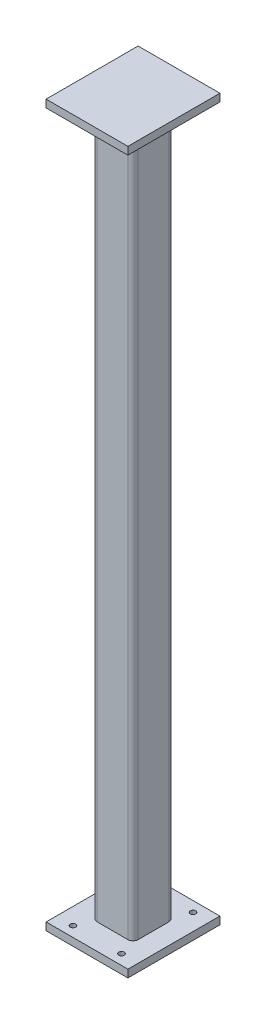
ISO-10303-21;
HEADER;
FILE_DESCRIPTION(('STEP AP214'),'2;1');
FILE_NAME('part.step','',(''),(''),'','','');
FILE_SCHEMA(('AUTOMOTIVE_DESIGN { 1 0 10303 214 1 1 1 1 }'));
ENDSEC;
DATA;
#1=APPLICATION_CONTEXT('core data for automotive mechanical design processes');
#2=APPLICATION_PROTOCOL_DEFINITION('international standard','automotive_design',2000,#1);
#3=PRODUCT_CONTEXT('',#1,'mechanical');
#4=PRODUCT('Part','Part','',(#3));
#5=PRODUCT_RELATED_PRODUCT_CATEGORY('part','',(#4));
#6=PRODUCT_DEFINITION_FORMATION('','',#4);
#7=PRODUCT_DEFINITION_CONTEXT('part definition',#1,'design');
#8=PRODUCT_DEFINITION('design','',#6,#7);
#9=PRODUCT_DEFINITION_SHAPE('','',#8);
#10=(LENGTH_UNIT() NAMED_UNIT(*) SI_UNIT(.MILLI.,.METRE.));
#11=(NAMED_UNIT(*) PLANE_ANGLE_UNIT() SI_UNIT($,.RADIAN.));
#12=(NAMED_UNIT(*) SI_UNIT($,.STERADIAN.) SOLID_ANGLE_UNIT());
#13=UNCERTAINTY_MEASURE_WITH_UNIT(LENGTH_MEASURE(1.E-05),#10,'distance_accuracy_value','');
#14=(GEOMETRIC_REPRESENTATION_CONTEXT(3) GLOBAL_UNCERTAINTY_ASSIGNED_CONTEXT((#13)) GLOBAL_UNIT_ASSIGNED_CONTEXT((#10,
#11,#12)) REPRESENTATION_CONTEXT('',''));
#15=CARTESIAN_POINT('',(0.,0.,0.));
#16=DIRECTION('',(0.,0.,1.));
#17=DIRECTION('',(1.,0.,0.));
#18=AXIS2_PLACEMENT_3D('',#15,#16,#17);
#19=CARTESIAN_POINT('',(50.8,9.525,-57.15));
#20=DIRECTION('',(0.,-1.,0.));
#21=DIRECTION('',(0.,0.,-1.));
#22=AXIS2_PLACEMENT_3D('',#19,#20,#21);
#23=PLANE('',#22);
#24=CARTESIAN_POINT('',(30.1625,9.525,44.45));
#25=DIRECTION('',(0.,1.,0.));
#26=DIRECTION('',(0.,0.,1.));
#27=AXIS2_PLACEMENT_3D('',#24,#25,#26);
#28=CIRCLE('',#27,3.37819999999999);
#29=CARTESIAN_POINT('',(30.1625,9.525,47.8282));
#30=VERTEX_POINT('',#29);
#31=EDGE_CURVE('E490',#30,#30,#28,.T.);
#32=ORIENTED_EDGE('',*,*,#31,.F.);
#33=EDGE_LOOP('',(#32));
#34=FACE_BOUND('',#33,.T.);
#35=CARTESIAN_POINT('',(30.1625,9.525,-44.45));
#36=DIRECTION('',(0.,1.,0.));
#37=DIRECTION('',(0.,0.,1.));
#38=AXIS2_PLACEMENT_3D('',#35,#36,#37);
#39=CIRCLE('',#38,3.37819999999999);
#40=CARTESIAN_POINT('',(30.1625,9.525,-41.0718));
#41=VERTEX_POINT('',#40);
#42=EDGE_CURVE('E492',#41,#41,#39,.T.);
#43=ORIENTED_EDGE('',*,*,#42,.F.);
#44=EDGE_LOOP('',(#43));
#45=FACE_BOUND('',#44,.T.);
#46=CARTESIAN_POINT('',(-30.1625,9.525,-44.45));
#47=DIRECTION('',(0.,1.,0.));
#48=DIRECTION('',(0.,0.,1.));
#49=AXIS2_PLACEMENT_3D('',#46,#47,#48);
#50=CIRCLE('',#49,3.37819999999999);
#51=CARTESIAN_POINT('',(-30.1625,9.525,-41.0718));
#52=VERTEX_POINT('',#51);
#53=EDGE_CURVE('E500',#52,#52,#50,.T.);
#54=ORIENTED_EDGE('',*,*,#53,.F.);
#55=EDGE_LOOP('',(#54));
#56=FACE_BOUND('',#55,.T.);
#57=CARTESIAN_POINT('',(-30.1625,9.525,44.45));
#58=DIRECTION('',(0.,1.,0.));
#59=DIRECTION('',(0.,0.,1.));
#60=AXIS2_PLACEMENT_3D('',#57,#58,#59);
#61=CIRCLE('',#60,3.37819999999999);
#62=CARTESIAN_POINT('',(-30.1625,9.525,47.8282));
#63=VERTEX_POINT('',#62);
#64=EDGE_CURVE('E506',#63,#63,#61,.T.);
#65=ORIENTED_EDGE('',*,*,#64,.F.);
#66=EDGE_LOOP('',(#65));
#67=FACE_BOUND('',#66,.T.);
#68=DIRECTION('',(0.,0.,-1.));
#69=VECTOR('',#68,1.);
#70=CARTESIAN_POINT('',(50.8,9.525,57.15));
#71=LINE('',#70,#69);
#72=CARTESIAN_POINT('',(50.8,9.525,57.15));
#73=VERTEX_POINT('',#72);
#74=CARTESIAN_POINT('',(50.8,9.525,-57.15));
#75=VERTEX_POINT('',#74);
#76=EDGE_CURVE('E197',#73,#75,#71,.T.);
#77=ORIENTED_EDGE('',*,*,#76,.T.);
#78=DIRECTION('',(-1.,0.,0.));
#79=VECTOR('',#78,1.);
#80=CARTESIAN_POINT('',(-50.8,9.525,-57.15));
#81=LINE('',#80,#79);
#82=CARTESIAN_POINT('',(-50.8,9.525,-57.15));
#83=VERTEX_POINT('',#82);
#84=EDGE_CURVE('E200',#75,#83,#81,.T.);
#85=ORIENTED_EDGE('',*,*,#84,.T.);
#86=DIRECTION('',(0.,0.,1.));
#87=VECTOR('',#86,1.);
#88=CARTESIAN_POINT('',(-50.8,9.525,57.15));
#89=LINE('',#88,#87);
#90=CARTESIAN_POINT('',(-50.8,9.525,57.15));
#91=VERTEX_POINT('',#90);
#92=EDGE_CURVE('E203',#83,#91,#89,.T.);
#93=ORIENTED_EDGE('',*,*,#92,.T.);
#94=DIRECTION('',(1.,0.,0.));
#95=VECTOR('',#94,1.);
#96=CARTESIAN_POINT('',(-50.8,9.525,57.15));
#97=LINE('',#96,#95);
#98=EDGE_CURVE('E205',#91,#73,#97,.T.);
#99=ORIENTED_EDGE('',*,*,#98,.T.);
#100=EDGE_LOOP('',(#77,#85,#93,#99));
#101=FACE_BOUND('',#100,.T.);
#102=DIRECTION('',(0.,0.,-1.));
#103=VECTOR('',#102,1.);
#104=CARTESIAN_POINT('',(25.4,9.525,25.4));
#105=LINE('',#104,#103);
#106=CARTESIAN_POINT('',(25.4,9.525,19.05));
#107=VERTEX_POINT('',#106);
#108=CARTESIAN_POINT('',(25.4,9.525,-19.05));
#109=VERTEX_POINT('',#108);
#110=EDGE_CURVE('E170',#107,#109,#105,.T.);
#111=ORIENTED_EDGE('',*,*,#110,.F.);
#112=CARTESIAN_POINT('',(19.05,9.52500000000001,19.05));
#113=DIRECTION('',(0.,-1.,0.));
#114=DIRECTION('',(0.,0.,-1.));
#115=AXIS2_PLACEMENT_3D('',#112,#113,#114);
#116=CIRCLE('',#115,6.35);
#117=CARTESIAN_POINT('',(19.05,9.525,25.4));
#118=VERTEX_POINT('',#117);
#119=EDGE_CURVE('E253',#107,#118,#116,.T.);
#120=ORIENTED_EDGE('',*,*,#119,.T.);
#121=DIRECTION('',(1.,0.,0.));
#122=VECTOR('',#121,1.);
#123=CARTESIAN_POINT('',(-25.4,9.525,25.4));
#124=LINE('',#123,#122);
#125=CARTESIAN_POINT('',(-19.05,9.525,25.4));
#126=VERTEX_POINT('',#125);
#127=EDGE_CURVE('E183',#126,#118,#124,.T.);
#128=ORIENTED_EDGE('',*,*,#127,.F.);
#129=CARTESIAN_POINT('',(-19.05,9.52500000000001,19.05));
#130=DIRECTION('',(0.,-1.,0.));
#131=DIRECTION('',(0.,0.,-1.));
#132=AXIS2_PLACEMENT_3D('',#129,#130,#131);
#133=CIRCLE('',#132,6.35);
#134=CARTESIAN_POINT('',(-25.4,9.525,19.05));
#135=VERTEX_POINT('',#134);
#136=EDGE_CURVE('E40',#126,#135,#133,.T.);
#137=ORIENTED_EDGE('',*,*,#136,.T.);
#138=DIRECTION('',(0.,0.,1.));
#139=VECTOR('',#138,1.);
#140=CARTESIAN_POINT('',(-25.4,9.525,25.4));
#141=LINE('',#140,#139);
#142=CARTESIAN_POINT('',(-25.4,9.525,-19.05));
#143=VERTEX_POINT('',#142);
#144=EDGE_CURVE('E193',#143,#135,#141,.T.);
#145=ORIENTED_EDGE('',*,*,#144,.F.);
#146=CARTESIAN_POINT('',(-19.05,9.52500000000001,-19.05));
#147=DIRECTION('',(0.,-1.,0.));
#148=DIRECTION('',(0.,0.,-1.));
#149=AXIS2_PLACEMENT_3D('',#146,#147,#148);
#150=CIRCLE('',#149,6.35);
#151=CARTESIAN_POINT('',(-19.05,9.525,-25.4));
#152=VERTEX_POINT('',#151);
#153=EDGE_CURVE('E245',#143,#152,#150,.T.);
#154=ORIENTED_EDGE('',*,*,#153,.T.);
#155=DIRECTION('',(-1.,0.,0.));
#156=VECTOR('',#155,1.);
#157=CARTESIAN_POINT('',(-25.4,9.525,-25.4));
#158=LINE('',#157,#156);
#159=CARTESIAN_POINT('',(19.05,9.525,-25.4));
#160=VERTEX_POINT('',#159);
#161=EDGE_CURVE('E173',#160,#152,#158,.T.);
#162=ORIENTED_EDGE('',*,*,#161,.F.);
#163=CARTESIAN_POINT('',(19.05,9.52500000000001,-19.05));
#164=DIRECTION('',(0.,-1.,0.));
#165=DIRECTION('',(0.,0.,-1.));
#166=AXIS2_PLACEMENT_3D('',#163,#164,#165);
#167=CIRCLE('',#166,6.35);
#168=EDGE_CURVE('E249',#160,#109,#167,.T.);
#169=ORIENTED_EDGE('',*,*,#168,.T.);
#170=EDGE_LOOP('',(#111,#120,#128,#137,#145,#154,#162,#169));
#171=FACE_BOUND('',#170,.T.);
#172=ADVANCED_FACE('F32',(#34,#45,#56,#67,#101,#171),#23,.F.);
#173=CARTESIAN_POINT('',(50.8,9.525,57.15));
#174=DIRECTION('',(-1.,0.,0.));
#175=DIRECTION('',(0.,0.,1.));
#176=AXIS2_PLACEMENT_3D('',#173,#174,#175);
#177=PLANE('',#176);
#178=DIRECTION('',(0.,0.,-1.));
#179=VECTOR('',#178,1.);
#180=CARTESIAN_POINT('',(50.8,0.,57.15));
#181=LINE('',#180,#179);
#182=CARTESIAN_POINT('',(50.8,0.,57.15));
#183=VERTEX_POINT('',#182);
#184=CARTESIAN_POINT('',(50.8,0.,-57.15));
#185=VERTEX_POINT('',#184);
#186=EDGE_CURVE('E189',#183,#185,#181,.T.);
#187=ORIENTED_EDGE('',*,*,#186,.T.);
#188=DIRECTION('',(0.,-1.,0.));
#189=VECTOR('',#188,1.);
#190=CARTESIAN_POINT('',(50.8,9.525,-57.15));
#191=LINE('',#190,#189);
#192=EDGE_CURVE('E223',#75,#185,#191,.T.);
#193=ORIENTED_EDGE('',*,*,#192,.F.);
#194=ORIENTED_EDGE('',*,*,#76,.F.);
#195=DIRECTION('',(0.,-1.,0.));
#196=VECTOR('',#195,1.);
#197=CARTESIAN_POINT('',(50.8,9.525,57.15));
#198=LINE('',#197,#196);
#199=EDGE_CURVE('E207',#73,#183,#198,.T.);
#200=ORIENTED_EDGE('',*,*,#199,.T.);
#201=EDGE_LOOP('',(#187,#193,#194,#200));
#202=FACE_BOUND('',#201,.T.);
#203=ADVANCED_FACE('F300',(#202),#177,.F.);
#204=CARTESIAN_POINT('',(-50.8,9.525,-57.15));
#205=DIRECTION('',(0.,0.,1.));
#206=DIRECTION('',(1.,0.,0.));
#207=AXIS2_PLACEMENT_3D('',#204,#205,#206);
#208=PLANE('',#207);
#209=DIRECTION('',(-1.,0.,0.));
#210=VECTOR('',#209,1.);
#211=CARTESIAN_POINT('',(-50.8,0.,-57.15));
#212=LINE('',#211,#210);
#213=CARTESIAN_POINT('',(-50.8,0.,-57.15));
#214=VERTEX_POINT('',#213);
#215=EDGE_CURVE('E210',#185,#214,#212,.T.);
#216=ORIENTED_EDGE('',*,*,#215,.T.);
#217=DIRECTION('',(0.,-1.,0.));
#218=VECTOR('',#217,1.);
#219=CARTESIAN_POINT('',(-50.8,9.525,-57.15));
#220=LINE('',#219,#218);
#221=EDGE_CURVE('E220',#83,#214,#220,.T.);
#222=ORIENTED_EDGE('',*,*,#221,.F.);
#223=ORIENTED_EDGE('',*,*,#84,.F.);
#224=ORIENTED_EDGE('',*,*,#192,.T.);
#225=EDGE_LOOP('',(#216,#222,#223,#224));
#226=FACE_BOUND('',#225,.T.);
#227=ADVANCED_FACE('F306',(#226),#208,.F.);
#228=CARTESIAN_POINT('',(-50.8,9.525,57.15));
#229=DIRECTION('',(1.,0.,0.));
#230=DIRECTION('',(0.,0.,-1.));
#231=AXIS2_PLACEMENT_3D('',#228,#229,#230);
#232=PLANE('',#231);
#233=DIRECTION('',(0.,0.,1.));
#234=VECTOR('',#233,1.);
#235=CARTESIAN_POINT('',(-50.8,0.,57.15));
#236=LINE('',#235,#234);
#237=CARTESIAN_POINT('',(-50.8,0.,57.15));
#238=VERTEX_POINT('',#237);
#239=EDGE_CURVE('E212',#214,#238,#236,.T.);
#240=ORIENTED_EDGE('',*,*,#239,.T.);
#241=DIRECTION('',(0.,-1.,0.));
#242=VECTOR('',#241,1.);
#243=CARTESIAN_POINT('',(-50.8,9.525,57.15));
#244=LINE('',#243,#242);
#245=EDGE_CURVE('E217',#91,#238,#244,.T.);
#246=ORIENTED_EDGE('',*,*,#245,.F.);
#247=ORIENTED_EDGE('',*,*,#92,.F.);
#248=ORIENTED_EDGE('',*,*,#221,.T.);
#249=EDGE_LOOP('',(#240,#246,#247,#248));
#250=FACE_BOUND('',#249,.T.);
#251=ADVANCED_FACE('F320',(#250),#232,.F.);
#252=CARTESIAN_POINT('',(-50.8,9.525,57.15));
#253=DIRECTION('',(0.,0.,-1.));
#254=DIRECTION('',(-1.,0.,0.));
#255=AXIS2_PLACEMENT_3D('',#252,#253,#254);
#256=PLANE('',#255);
#257=DIRECTION('',(1.,0.,0.));
#258=VECTOR('',#257,1.);
#259=CARTESIAN_POINT('',(-50.8,0.,57.15));
#260=LINE('',#259,#258);
#261=EDGE_CURVE('E201',#238,#183,#260,.T.);
#262=ORIENTED_EDGE('',*,*,#261,.T.);
#263=ORIENTED_EDGE('',*,*,#199,.F.);
#264=ORIENTED_EDGE('',*,*,#98,.F.);
#265=ORIENTED_EDGE('',*,*,#245,.T.);
#266=EDGE_LOOP('',(#262,#263,#264,#265));
#267=FACE_BOUND('',#266,.T.);
#268=ADVANCED_FACE('F316',(#267),#256,.F.);
#269=CARTESIAN_POINT('',(50.8,0.,-57.15));
#270=DIRECTION('',(0.,-1.,0.));
#271=DIRECTION('',(0.,0.,-1.));
#272=AXIS2_PLACEMENT_3D('',#269,#270,#271);
#273=PLANE('',#272);
#274=CARTESIAN_POINT('',(30.1625,0.,44.45));
#275=DIRECTION('',(0.,1.,0.));
#276=DIRECTION('',(0.,0.,1.));
#277=AXIS2_PLACEMENT_3D('',#274,#275,#276);
#278=CIRCLE('',#277,3.3782);
#279=CARTESIAN_POINT('',(30.1625,0.,47.8282));
#280=VERTEX_POINT('',#279);
#281=EDGE_CURVE('E488',#280,#280,#278,.T.);
#282=ORIENTED_EDGE('',*,*,#281,.T.);
#283=EDGE_LOOP('',(#282));
#284=FACE_BOUND('',#283,.T.);
#285=CARTESIAN_POINT('',(30.1625,0.,-44.45));
#286=DIRECTION('',(0.,1.,0.));
#287=DIRECTION('',(0.,0.,1.));
#288=AXIS2_PLACEMENT_3D('',#285,#286,#287);
#289=CIRCLE('',#288,3.3782);
#290=CARTESIAN_POINT('',(30.1625,0.,-41.0718));
#291=VERTEX_POINT('',#290);
#292=EDGE_CURVE('E497',#291,#291,#289,.T.);
#293=ORIENTED_EDGE('',*,*,#292,.T.);
#294=EDGE_LOOP('',(#293));
#295=FACE_BOUND('',#294,.T.);
#296=CARTESIAN_POINT('',(-30.1625,0.,-44.45));
#297=DIRECTION('',(0.,1.,0.));
#298=DIRECTION('',(0.,0.,1.));
#299=AXIS2_PLACEMENT_3D('',#296,#297,#298);
#300=CIRCLE('',#299,3.3782);
#301=CARTESIAN_POINT('',(-30.1625,0.,-41.0718));
#302=VERTEX_POINT('',#301);
#303=EDGE_CURVE('E503',#302,#302,#300,.T.);
#304=ORIENTED_EDGE('',*,*,#303,.T.);
#305=EDGE_LOOP('',(#304));
#306=FACE_BOUND('',#305,.T.);
#307=CARTESIAN_POINT('',(-30.1625,0.,44.45));
#308=DIRECTION('',(0.,1.,0.));
#309=DIRECTION('',(0.,0.,1.));
#310=AXIS2_PLACEMENT_3D('',#307,#308,#309);
#311=CIRCLE('',#310,3.3782);
#312=CARTESIAN_POINT('',(-30.1625,0.,47.8282));
#313=VERTEX_POINT('',#312);
#314=EDGE_CURVE('E509',#313,#313,#311,.T.);
#315=ORIENTED_EDGE('',*,*,#314,.T.);
#316=EDGE_LOOP('',(#315));
#317=FACE_BOUND('',#316,.T.);
#318=ORIENTED_EDGE('',*,*,#186,.F.);
#319=ORIENTED_EDGE('',*,*,#261,.F.);
#320=ORIENTED_EDGE('',*,*,#239,.F.);
#321=ORIENTED_EDGE('',*,*,#215,.F.);
#322=EDGE_LOOP('',(#318,#319,#320,#321));
#323=FACE_BOUND('',#322,.T.);
#324=ADVANCED_FACE('F313',(#284,#295,#306,#317,#323),#273,.T.);
#325=CARTESIAN_POINT('',(25.4,885.357699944,25.4));
#326=DIRECTION('',(-1.,0.,0.));
#327=DIRECTION('',(0.,0.,1.));
#328=AXIS2_PLACEMENT_3D('',#325,#326,#327);
#329=PLANE('',#328);
#330=ORIENTED_EDGE('',*,*,#110,.T.);
#331=DIRECTION('',(0.,-1.,0.));
#332=VECTOR('',#331,1.);
#333=CARTESIAN_POINT('',(25.4,885.357699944,-19.05));
#334=LINE('',#333,#332);
#335=CARTESIAN_POINT('',(25.4,885.357699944,-19.05));
#336=VERTEX_POINT('',#335);
#337=EDGE_CURVE('E239',#109,#336,#334,.F.);
#338=ORIENTED_EDGE('',*,*,#337,.T.);
#339=DIRECTION('',(0.,0.,-1.));
#340=VECTOR('',#339,1.);
#341=CARTESIAN_POINT('',(25.4,885.357699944,25.4));
#342=LINE('',#341,#340);
#343=CARTESIAN_POINT('',(25.4,885.357699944,19.05));
#344=VERTEX_POINT('',#343);
#345=EDGE_CURVE('E179',#344,#336,#342,.T.);
#346=ORIENTED_EDGE('',*,*,#345,.F.);
#347=DIRECTION('',(0.,-1.,0.));
#348=VECTOR('',#347,1.);
#349=CARTESIAN_POINT('',(25.4,885.357699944,19.05));
#350=LINE('',#349,#348);
#351=EDGE_CURVE('E236',#344,#107,#350,.T.);
#352=ORIENTED_EDGE('',*,*,#351,.T.);
#353=EDGE_LOOP('',(#330,#338,#346,#352));
#354=FACE_BOUND('',#353,.T.);
#355=ADVANCED_FACE('F275',(#354),#329,.F.);
#356=CARTESIAN_POINT('',(-25.4,885.357699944,-25.4));
#357=DIRECTION('',(0.,0.,1.));
#358=DIRECTION('',(1.,0.,0.));
#359=AXIS2_PLACEMENT_3D('',#356,#357,#358);
#360=PLANE('',#359);
#361=ORIENTED_EDGE('',*,*,#161,.T.);
#362=DIRECTION('',(0.,-1.,0.));
#363=VECTOR('',#362,1.);
#364=CARTESIAN_POINT('',(-19.05,885.357699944,-25.4));
#365=LINE('',#364,#363);
#366=CARTESIAN_POINT('',(-19.05,885.357699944,-25.4));
#367=VERTEX_POINT('',#366);
#368=EDGE_CURVE('E234',#152,#367,#365,.F.);
#369=ORIENTED_EDGE('',*,*,#368,.T.);
#370=DIRECTION('',(-1.,0.,0.));
#371=VECTOR('',#370,1.);
#372=CARTESIAN_POINT('',(-25.4,885.357699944,-25.4));
#373=LINE('',#372,#371);
#374=CARTESIAN_POINT('',(19.05,885.357699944,-25.4));
#375=VERTEX_POINT('',#374);
#376=EDGE_CURVE('E182',#375,#367,#373,.T.);
#377=ORIENTED_EDGE('',*,*,#376,.F.);
#378=DIRECTION('',(0.,-1.,0.));
#379=VECTOR('',#378,1.);
#380=CARTESIAN_POINT('',(19.05,885.357699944,-25.4));
#381=LINE('',#380,#379);
#382=EDGE_CURVE('E231',#375,#160,#381,.T.);
#383=ORIENTED_EDGE('',*,*,#382,.T.);
#384=EDGE_LOOP('',(#361,#369,#377,#383));
#385=FACE_BOUND('',#384,.T.);
#386=ADVANCED_FACE('F284',(#385),#360,.F.);
#387=CARTESIAN_POINT('',(-25.4,885.357699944,25.4));
#388=DIRECTION('',(1.,0.,0.));
#389=DIRECTION('',(0.,0.,-1.));
#390=AXIS2_PLACEMENT_3D('',#387,#388,#389);
#391=PLANE('',#390);
#392=DIRECTION('',(0.,0.,1.));
#393=VECTOR('',#392,1.);
#394=CARTESIAN_POINT('',(-25.4,885.357699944,25.4));
#395=LINE('',#394,#393);
#396=CARTESIAN_POINT('',(-25.4,885.357699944,-19.05));
#397=VERTEX_POINT('',#396);
#398=CARTESIAN_POINT('',(-25.4,885.357699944,19.05));
#399=VERTEX_POINT('',#398);
#400=EDGE_CURVE('E186',#397,#399,#395,.T.);
#401=ORIENTED_EDGE('',*,*,#400,.F.);
#402=DIRECTION('',(0.,-1.,0.));
#403=VECTOR('',#402,1.);
#404=CARTESIAN_POINT('',(-25.4,885.357699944,-19.05));
#405=LINE('',#404,#403);
#406=EDGE_CURVE('E228',#397,#143,#405,.T.);
#407=ORIENTED_EDGE('',*,*,#406,.T.);
#408=ORIENTED_EDGE('',*,*,#144,.T.);
#409=DIRECTION('',(0.,-1.,0.));
#410=VECTOR('',#409,1.);
#411=CARTESIAN_POINT('',(-25.4,885.357699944,19.05));
#412=LINE('',#411,#410);
#413=EDGE_CURVE('E226',#135,#399,#412,.F.);
#414=ORIENTED_EDGE('',*,*,#413,.T.);
#415=EDGE_LOOP('',(#401,#407,#408,#414));
#416=FACE_BOUND('',#415,.T.);
#417=ADVANCED_FACE('F265',(#416),#391,.F.);
#418=CARTESIAN_POINT('',(-25.4,885.357699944,25.4));
#419=DIRECTION('',(0.,0.,-1.));
#420=DIRECTION('',(-1.,0.,0.));
#421=AXIS2_PLACEMENT_3D('',#418,#419,#420);
#422=PLANE('',#421);
#423=ORIENTED_EDGE('',*,*,#127,.T.);
#424=DIRECTION('',(0.,-1.,0.));
#425=VECTOR('',#424,1.);
#426=CARTESIAN_POINT('',(19.05,885.357699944,25.4));
#427=LINE('',#426,#425);
#428=CARTESIAN_POINT('',(19.05,885.357699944,25.4));
#429=VERTEX_POINT('',#428);
#430=EDGE_CURVE('E47',#118,#429,#427,.F.);
#431=ORIENTED_EDGE('',*,*,#430,.T.);
#432=DIRECTION('',(1.,0.,0.));
#433=VECTOR('',#432,1.);
#434=CARTESIAN_POINT('',(-25.4,885.357699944,25.4));
#435=LINE('',#434,#433);
#436=CARTESIAN_POINT('',(-19.05,885.357699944,25.4));
#437=VERTEX_POINT('',#436);
#438=EDGE_CURVE('E188',#437,#429,#435,.T.);
#439=ORIENTED_EDGE('',*,*,#438,.F.);
#440=DIRECTION('',(0.,-1.,0.));
#441=VECTOR('',#440,1.);
#442=CARTESIAN_POINT('',(-19.05,885.357699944,25.4));
#443=LINE('',#442,#441);
#444=EDGE_CURVE('E241',#437,#126,#443,.T.);
#445=ORIENTED_EDGE('',*,*,#444,.T.);
#446=EDGE_LOOP('',(#423,#431,#439,#445));
#447=FACE_BOUND('',#446,.T.);
#448=ADVANCED_FACE('F267',(#447),#422,.F.);
#449=CARTESIAN_POINT('',(50.8,885.357699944,-57.15));
#450=DIRECTION('',(0.,-1.,0.));
#451=DIRECTION('',(0.,0.,-1.));
#452=AXIS2_PLACEMENT_3D('',#449,#450,#451);
#453=PLANE('',#452);
#454=DIRECTION('',(0.,0.,-1.));
#455=VECTOR('',#454,1.);
#456=CARTESIAN_POINT('',(50.8,885.357699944,57.15));
#457=LINE('',#456,#455);
#458=CARTESIAN_POINT('',(50.8,885.357699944,57.15));
#459=VERTEX_POINT('',#458);
#460=CARTESIAN_POINT('',(50.8,885.357699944,-57.15));
#461=VERTEX_POINT('',#460);
#462=EDGE_CURVE('E169',#459,#461,#457,.T.);
#463=ORIENTED_EDGE('',*,*,#462,.F.);
#464=DIRECTION('',(1.,0.,0.));
#465=VECTOR('',#464,1.);
#466=CARTESIAN_POINT('',(-50.8,885.357699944,57.15));
#467=LINE('',#466,#465);
#468=CARTESIAN_POINT('',(-50.8,885.357699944,57.15));
#469=VERTEX_POINT('',#468);
#470=EDGE_CURVE('E165',#469,#459,#467,.T.);
#471=ORIENTED_EDGE('',*,*,#470,.F.);
#472=DIRECTION('',(0.,0.,1.));
#473=VECTOR('',#472,1.);
#474=CARTESIAN_POINT('',(-50.8,885.357699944,57.15));
#475=LINE('',#474,#473);
#476=CARTESIAN_POINT('',(-50.8,885.357699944,-57.15));
#477=VERTEX_POINT('',#476);
#478=EDGE_CURVE('E518',#477,#469,#475,.T.);
#479=ORIENTED_EDGE('',*,*,#478,.F.);
#480=DIRECTION('',(-1.,0.,0.));
#481=VECTOR('',#480,1.);
#482=CARTESIAN_POINT('',(-50.8,885.357699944,-57.15));
#483=LINE('',#482,#481);
#484=EDGE_CURVE('E516',#461,#477,#483,.T.);
#485=ORIENTED_EDGE('',*,*,#484,.F.);
#486=EDGE_LOOP('',(#463,#471,#479,#485));
#487=FACE_BOUND('',#486,.T.);
#488=ORIENTED_EDGE('',*,*,#438,.T.);
#489=CARTESIAN_POINT('',(19.05,885.357699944,19.05));
#490=DIRECTION('',(0.,-1.,0.));
#491=DIRECTION('',(0.,0.,-1.));
#492=AXIS2_PLACEMENT_3D('',#489,#490,#491);
#493=CIRCLE('',#492,6.35);
#494=EDGE_CURVE('E255',#429,#344,#493,.F.);
#495=ORIENTED_EDGE('',*,*,#494,.T.);
#496=ORIENTED_EDGE('',*,*,#345,.T.);
#497=CARTESIAN_POINT('',(19.05,885.357699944,-19.05));
#498=DIRECTION('',(0.,-1.,0.));
#499=DIRECTION('',(0.,0.,-1.));
#500=AXIS2_PLACEMENT_3D('',#497,#498,#499);
#501=CIRCLE('',#500,6.35);
#502=EDGE_CURVE('E251',#336,#375,#501,.F.);
#503=ORIENTED_EDGE('',*,*,#502,.T.);
#504=ORIENTED_EDGE('',*,*,#376,.T.);
#505=CARTESIAN_POINT('',(-19.05,885.357699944,-19.05));
#506=DIRECTION('',(0.,-1.,0.));
#507=DIRECTION('',(0.,0.,-1.));
#508=AXIS2_PLACEMENT_3D('',#505,#506,#507);
#509=CIRCLE('',#508,6.35);
#510=EDGE_CURVE('E247',#367,#397,#509,.F.);
#511=ORIENTED_EDGE('',*,*,#510,.T.);
#512=ORIENTED_EDGE('',*,*,#400,.T.);
#513=CARTESIAN_POINT('',(-19.05,885.357699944,19.05));
#514=DIRECTION('',(0.,-1.,0.));
#515=DIRECTION('',(0.,0.,-1.));
#516=AXIS2_PLACEMENT_3D('',#513,#514,#515);
#517=CIRCLE('',#516,6.35);
#518=EDGE_CURVE('E11',#399,#437,#517,.F.);
#519=ORIENTED_EDGE('',*,*,#518,.T.);
#520=EDGE_LOOP('',(#488,#495,#496,#503,#504,#511,#512,#519));
#521=FACE_BOUND('',#520,.T.);
#522=ADVANCED_FACE('F269',(#487,#521),#453,.T.);
#523=CARTESIAN_POINT('',(50.8,894.882699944,57.15));
#524=DIRECTION('',(-1.,0.,0.));
#525=DIRECTION('',(0.,0.,1.));
#526=AXIS2_PLACEMENT_3D('',#523,#524,#525);
#527=PLANE('',#526);
#528=ORIENTED_EDGE('',*,*,#462,.T.);
#529=DIRECTION('',(0.,-1.,0.));
#530=VECTOR('',#529,1.);
#531=CARTESIAN_POINT('',(50.8,894.882699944,-57.15));
#532=LINE('',#531,#530);
#533=CARTESIAN_POINT('',(50.8,894.882699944,-57.15));
#534=VERTEX_POINT('',#533);
#535=EDGE_CURVE('E149',#534,#461,#532,.T.);
#536=ORIENTED_EDGE('',*,*,#535,.F.);
#537=DIRECTION('',(0.,0.,-1.));
#538=VECTOR('',#537,1.);
#539=CARTESIAN_POINT('',(50.8,894.882699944,57.15));
#540=LINE('',#539,#538);
#541=CARTESIAN_POINT('',(50.8,894.882699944,57.15));
#542=VERTEX_POINT('',#541);
#543=EDGE_CURVE('E156',#542,#534,#540,.T.);
#544=ORIENTED_EDGE('',*,*,#543,.F.);
#545=DIRECTION('',(0.,-1.,0.));
#546=VECTOR('',#545,1.);
#547=CARTESIAN_POINT('',(50.8,894.882699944,57.15));
#548=LINE('',#547,#546);
#549=EDGE_CURVE('E514',#542,#459,#548,.T.);
#550=ORIENTED_EDGE('',*,*,#549,.T.);
#551=EDGE_LOOP('',(#528,#536,#544,#550));
#552=FACE_BOUND('',#551,.T.);
#553=ADVANCED_FACE('F167',(#552),#527,.F.);
#554=CARTESIAN_POINT('',(-50.8,894.882699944,-57.15));
#555=DIRECTION('',(0.,0.,1.));
#556=DIRECTION('',(1.,0.,0.));
#557=AXIS2_PLACEMENT_3D('',#554,#555,#556);
#558=PLANE('',#557);
#559=ORIENTED_EDGE('',*,*,#484,.T.);
#560=DIRECTION('',(0.,-1.,0.));
#561=VECTOR('',#560,1.);
#562=CARTESIAN_POINT('',(-50.8,894.882699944,-57.15));
#563=LINE('',#562,#561);
#564=CARTESIAN_POINT('',(-50.8,894.882699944,-57.15));
#565=VERTEX_POINT('',#564);
#566=EDGE_CURVE('E152',#565,#477,#563,.T.);
#567=ORIENTED_EDGE('',*,*,#566,.F.);
#568=DIRECTION('',(-1.,0.,0.));
#569=VECTOR('',#568,1.);
#570=CARTESIAN_POINT('',(-50.8,894.882699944,-57.15));
#571=LINE('',#570,#569);
#572=EDGE_CURVE('E145',#534,#565,#571,.T.);
#573=ORIENTED_EDGE('',*,*,#572,.F.);
#574=ORIENTED_EDGE('',*,*,#535,.T.);
#575=EDGE_LOOP('',(#559,#567,#573,#574));
#576=FACE_BOUND('',#575,.T.);
#577=ADVANCED_FACE('F147',(#576),#558,.F.);
#578=CARTESIAN_POINT('',(-50.8,894.882699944,57.15));
#579=DIRECTION('',(1.,0.,0.));
#580=DIRECTION('',(0.,0.,-1.));
#581=AXIS2_PLACEMENT_3D('',#578,#579,#580);
#582=PLANE('',#581);
#583=ORIENTED_EDGE('',*,*,#478,.T.);
#584=DIRECTION('',(0.,-1.,0.));
#585=VECTOR('',#584,1.);
#586=CARTESIAN_POINT('',(-50.8,894.882699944,57.15));
#587=LINE('',#586,#585);
#588=CARTESIAN_POINT('',(-50.8,894.882699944,57.15));
#589=VERTEX_POINT('',#588);
#590=EDGE_CURVE('E175',#589,#469,#587,.T.);
#591=ORIENTED_EDGE('',*,*,#590,.F.);
#592=DIRECTION('',(0.,0.,1.));
#593=VECTOR('',#592,1.);
#594=CARTESIAN_POINT('',(-50.8,894.882699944,57.15));
#595=LINE('',#594,#593);
#596=EDGE_CURVE('E155',#565,#589,#595,.T.);
#597=ORIENTED_EDGE('',*,*,#596,.F.);
#598=ORIENTED_EDGE('',*,*,#566,.T.);
#599=EDGE_LOOP('',(#583,#591,#597,#598));
#600=FACE_BOUND('',#599,.T.);
#601=ADVANCED_FACE('F398',(#600),#582,.F.);
#602=CARTESIAN_POINT('',(-50.8,894.882699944,57.15));
#603=DIRECTION('',(0.,0.,-1.));
#604=DIRECTION('',(-1.,0.,0.));
#605=AXIS2_PLACEMENT_3D('',#602,#603,#604);
#606=PLANE('',#605);
#607=ORIENTED_EDGE('',*,*,#470,.T.);
#608=ORIENTED_EDGE('',*,*,#549,.F.);
#609=DIRECTION('',(1.,0.,0.));
#610=VECTOR('',#609,1.);
#611=CARTESIAN_POINT('',(-50.8,894.882699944,57.15));
#612=LINE('',#611,#610);
#613=EDGE_CURVE('E161',#589,#542,#612,.T.);
#614=ORIENTED_EDGE('',*,*,#613,.F.);
#615=ORIENTED_EDGE('',*,*,#590,.T.);
#616=EDGE_LOOP('',(#607,#608,#614,#615));
#617=FACE_BOUND('',#616,.T.);
#618=ADVANCED_FACE('F296',(#617),#606,.F.);
#619=CARTESIAN_POINT('',(50.8,894.882699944,-57.15));
#620=DIRECTION('',(0.,-1.,0.));
#621=DIRECTION('',(0.,0.,-1.));
#622=AXIS2_PLACEMENT_3D('',#619,#620,#621);
#623=PLANE('',#622);
#624=ORIENTED_EDGE('',*,*,#543,.T.);
#625=ORIENTED_EDGE('',*,*,#572,.T.);
#626=ORIENTED_EDGE('',*,*,#596,.T.);
#627=ORIENTED_EDGE('',*,*,#613,.T.);
#628=EDGE_LOOP('',(#624,#625,#626,#627));
#629=FACE_BOUND('',#628,.T.);
#630=ADVANCED_FACE('F159',(#629),#623,.F.);
#631=CARTESIAN_POINT('',(-19.05,885.357699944,-19.05));
#632=DIRECTION('',(0.,-1.,0.));
#633=DIRECTION('',(0.,0.,-1.));
#634=AXIS2_PLACEMENT_3D('',#631,#632,#633);
#635=CYLINDRICAL_SURFACE('',#634,6.35);
#636=ORIENTED_EDGE('',*,*,#510,.F.);
#637=ORIENTED_EDGE('',*,*,#368,.F.);
#638=ORIENTED_EDGE('',*,*,#153,.F.);
#639=ORIENTED_EDGE('',*,*,#406,.F.);
#640=EDGE_LOOP('',(#636,#637,#638,#639));
#641=FACE_BOUND('',#640,.T.);
#642=ADVANCED_FACE('F288',(#641),#635,.T.);
#643=CARTESIAN_POINT('',(19.05,885.357699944,-19.05));
#644=DIRECTION('',(0.,-1.,0.));
#645=DIRECTION('',(0.,0.,-1.));
#646=AXIS2_PLACEMENT_3D('',#643,#644,#645);
#647=CYLINDRICAL_SURFACE('',#646,6.35);
#648=ORIENTED_EDGE('',*,*,#502,.F.);
#649=ORIENTED_EDGE('',*,*,#337,.F.);
#650=ORIENTED_EDGE('',*,*,#168,.F.);
#651=ORIENTED_EDGE('',*,*,#382,.F.);
#652=EDGE_LOOP('',(#648,#649,#650,#651));
#653=FACE_BOUND('',#652,.T.);
#654=ADVANCED_FACE('F281',(#653),#647,.T.);
#655=CARTESIAN_POINT('',(19.05,885.357699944,19.05));
#656=DIRECTION('',(0.,-1.,0.));
#657=DIRECTION('',(0.,0.,-1.));
#658=AXIS2_PLACEMENT_3D('',#655,#656,#657);
#659=CYLINDRICAL_SURFACE('',#658,6.35);
#660=ORIENTED_EDGE('',*,*,#494,.F.);
#661=ORIENTED_EDGE('',*,*,#430,.F.);
#662=ORIENTED_EDGE('',*,*,#119,.F.);
#663=ORIENTED_EDGE('',*,*,#351,.F.);
#664=EDGE_LOOP('',(#660,#661,#662,#663));
#665=FACE_BOUND('',#664,.T.);
#666=ADVANCED_FACE('F273',(#665),#659,.T.);
#667=CARTESIAN_POINT('',(-19.05,885.357699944,19.05));
#668=DIRECTION('',(0.,-1.,0.));
#669=DIRECTION('',(0.,0.,-1.));
#670=AXIS2_PLACEMENT_3D('',#667,#668,#669);
#671=CYLINDRICAL_SURFACE('',#670,6.35);
#672=ORIENTED_EDGE('',*,*,#518,.F.);
#673=ORIENTED_EDGE('',*,*,#413,.F.);
#674=ORIENTED_EDGE('',*,*,#136,.F.);
#675=ORIENTED_EDGE('',*,*,#444,.F.);
#676=EDGE_LOOP('',(#672,#673,#674,#675));
#677=FACE_BOUND('',#676,.T.);
#678=ADVANCED_FACE('F34',(#677),#671,.T.);
#679=CARTESIAN_POINT('',(-30.1625,9.525,44.45));
#680=DIRECTION('',(0.,1.,0.));
#681=DIRECTION('',(0.,0.,1.));
#682=AXIS2_PLACEMENT_3D('',#679,#680,#681);
#683=CYLINDRICAL_SURFACE('',#682,3.37819999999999);
#684=ORIENTED_EDGE('',*,*,#314,.F.);
#685=EDGE_LOOP('',(#684));
#686=FACE_BOUND('',#685,.T.);
#687=ORIENTED_EDGE('',*,*,#64,.T.);
#688=EDGE_LOOP('',(#687));
#689=FACE_BOUND('',#688,.T.);
#690=ADVANCED_FACE('F443',(#686,#689),#683,.F.);
#691=CARTESIAN_POINT('',(-30.1625,9.525,-44.45));
#692=DIRECTION('',(0.,1.,0.));
#693=DIRECTION('',(0.,0.,1.));
#694=AXIS2_PLACEMENT_3D('',#691,#692,#693);
#695=CYLINDRICAL_SURFACE('',#694,3.37819999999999);
#696=ORIENTED_EDGE('',*,*,#303,.F.);
#697=EDGE_LOOP('',(#696));
#698=FACE_BOUND('',#697,.T.);
#699=ORIENTED_EDGE('',*,*,#53,.T.);
#700=EDGE_LOOP('',(#699));
#701=FACE_BOUND('',#700,.T.);
#702=ADVANCED_FACE('F449',(#698,#701),#695,.F.);
#703=CARTESIAN_POINT('',(30.1625,9.525,-44.45));
#704=DIRECTION('',(0.,1.,0.));
#705=DIRECTION('',(0.,0.,1.));
#706=AXIS2_PLACEMENT_3D('',#703,#704,#705);
#707=CYLINDRICAL_SURFACE('',#706,3.37819999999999);
#708=ORIENTED_EDGE('',*,*,#292,.F.);
#709=EDGE_LOOP('',(#708));
#710=FACE_BOUND('',#709,.T.);
#711=ORIENTED_EDGE('',*,*,#42,.T.);
#712=EDGE_LOOP('',(#711));
#713=FACE_BOUND('',#712,.T.);
#714=ADVANCED_FACE('F458',(#710,#713),#707,.F.);
#715=CARTESIAN_POINT('',(30.1625,9.525,44.45));
#716=DIRECTION('',(0.,1.,0.));
#717=DIRECTION('',(0.,0.,1.));
#718=AXIS2_PLACEMENT_3D('',#715,#716,#717);
#719=CYLINDRICAL_SURFACE('',#718,3.37819999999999);
#720=ORIENTED_EDGE('',*,*,#281,.F.);
#721=EDGE_LOOP('',(#720));
#722=FACE_BOUND('',#721,.T.);
#723=ORIENTED_EDGE('',*,*,#31,.T.);
#724=EDGE_LOOP('',(#723));
#725=FACE_BOUND('',#724,.T.);
#726=ADVANCED_FACE('F467',(#722,#725),#719,.F.);
#727=CLOSED_SHELL('',(#172,#203,#227,#251,#268,#324,#355,#386,#417,#448,#522,#553,#577,#601,
#618,#630,#642,#654,#666,#678,#690,#702,#714,#726));
#728=MANIFOLD_SOLID_BREP('B2',#727);
#729=ADVANCED_BREP_SHAPE_REPRESENTATION('',(#18,#728),#14);
#730=SHAPE_DEFINITION_REPRESENTATION(#9,#729);
ENDSEC;
END-ISO-10303-21;
